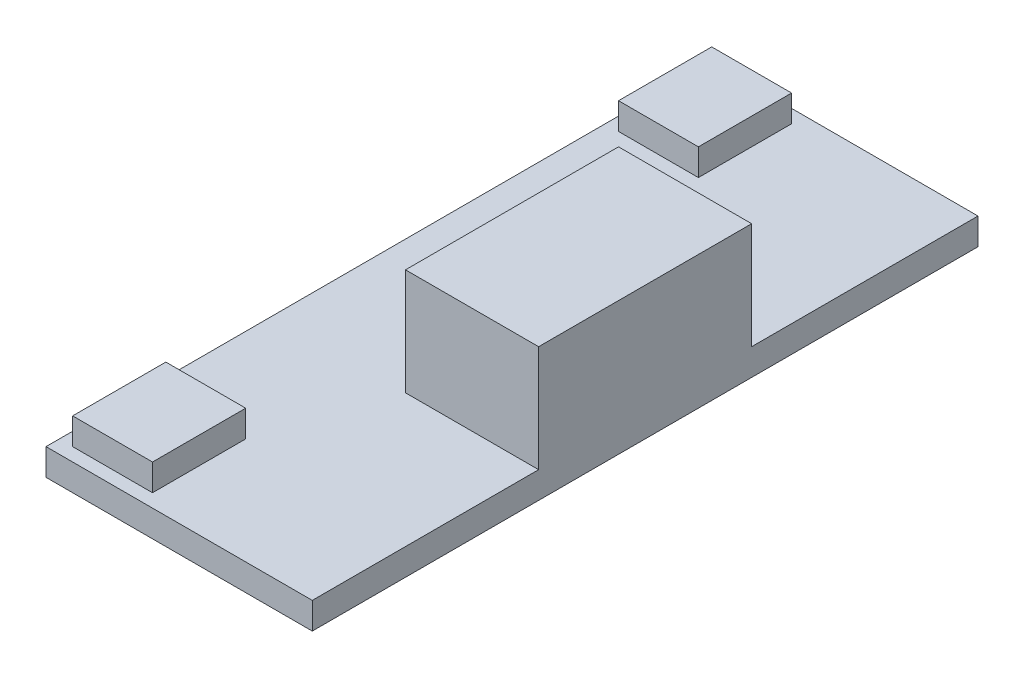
from build123d import *

# Parameters (mm, degrees)
SKETCH1_W           = 10
SKETCH1_H           = 25
BOSS_EXTRUDE1_DEPTH = 1
SKETCH2_W           = 5
SKETCH2_H           = 8
BOSS_EXTRUDE2_DEPTH = 4
SKETCH2_3_W         = 3
SKETCH2_3_H         = 3.5
BOSS_EXTRUDE3_DEPTH = 1


with BuildPart() as part:
    # Sketch1 → Boss-Extrude1 (new body)
    with BuildSketch(Plane(origin=(0, 0, 0), x_dir=(1, 0, 0), z_dir=(0, 1, 0))):
        Rectangle(SKETCH1_W, SKETCH1_H)
    extrude(amount=BOSS_EXTRUDE1_DEPTH)

    # Sketch2 → Boss-Extrude2 (add)
    with BuildSketch(Plane(origin=(0, 1, 0), x_dir=(1, 0, 0), z_dir=(0, 1, 0))):
        with Locations((2.5, 0)):
            Rectangle(SKETCH2_W, SKETCH2_H)
    extrude(amount=BOSS_EXTRUDE2_DEPTH)

    # Sketch2_3 → Boss-Extrude3 (add)
    with BuildSketch(Plane(origin=(0, 1, 0), x_dir=(1, 0, 0), z_dir=(0, 1, 0))):
        with Locations((-3, -10.25)):
            Rectangle(SKETCH2_3_W, SKETCH2_3_H)
        with Locations((-3, 10.25)):
            Rectangle(SKETCH2_3_W, SKETCH2_3_H)
    extrude(amount=BOSS_EXTRUDE3_DEPTH)


solid = part.part
